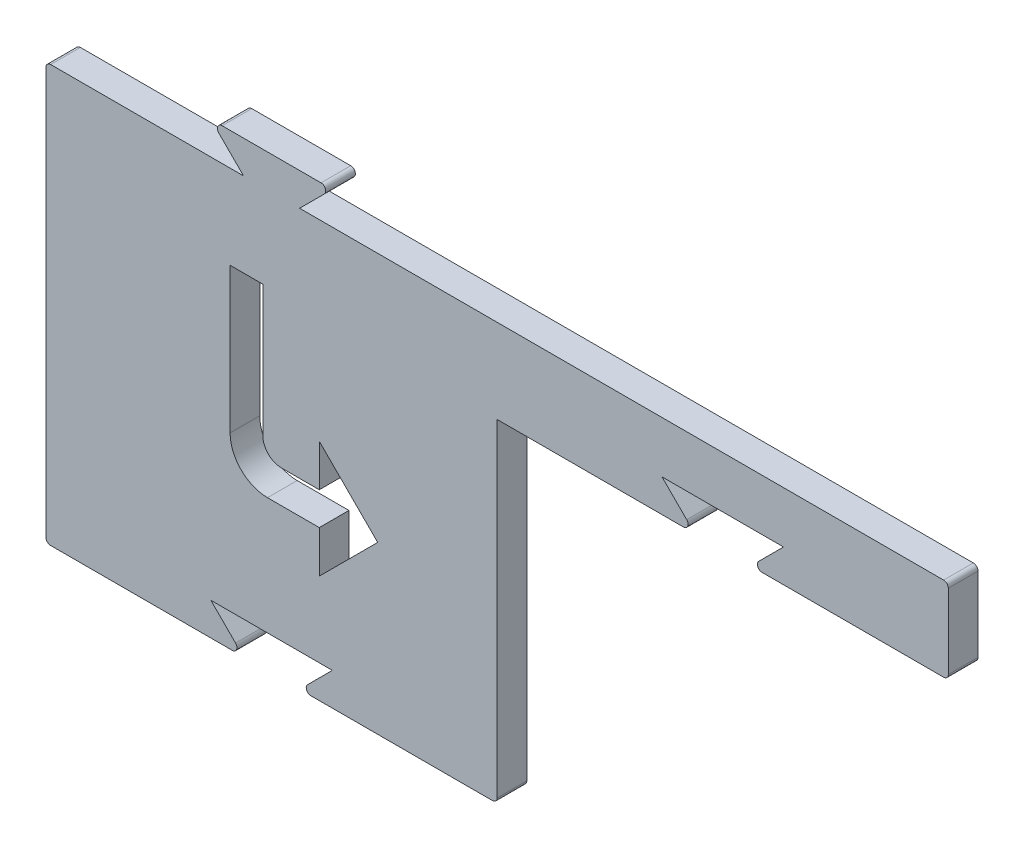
ISO-10303-21;
HEADER;
FILE_DESCRIPTION(('STEP AP214'),'2;1');
FILE_NAME('part.step','',(''),(''),'','','');
FILE_SCHEMA(('AUTOMOTIVE_DESIGN { 1 0 10303 214 1 1 1 1 }'));
ENDSEC;
DATA;
#1=APPLICATION_CONTEXT('core data for automotive mechanical design processes');
#2=APPLICATION_PROTOCOL_DEFINITION('international standard','automotive_design',2000,#1);
#3=PRODUCT_CONTEXT('',#1,'mechanical');
#4=PRODUCT('Part','Part','',(#3));
#5=PRODUCT_RELATED_PRODUCT_CATEGORY('part','',(#4));
#6=PRODUCT_DEFINITION_FORMATION('','',#4);
#7=PRODUCT_DEFINITION_CONTEXT('part definition',#1,'design');
#8=PRODUCT_DEFINITION('design','',#6,#7);
#9=PRODUCT_DEFINITION_SHAPE('','',#8);
#10=(LENGTH_UNIT() NAMED_UNIT(*) SI_UNIT(.MILLI.,.METRE.));
#11=(NAMED_UNIT(*) PLANE_ANGLE_UNIT() SI_UNIT($,.RADIAN.));
#12=(NAMED_UNIT(*) SI_UNIT($,.STERADIAN.) SOLID_ANGLE_UNIT());
#13=UNCERTAINTY_MEASURE_WITH_UNIT(LENGTH_MEASURE(1.E-05),#10,'distance_accuracy_value','');
#14=(GEOMETRIC_REPRESENTATION_CONTEXT(3) GLOBAL_UNCERTAINTY_ASSIGNED_CONTEXT((#13)) GLOBAL_UNIT_ASSIGNED_CONTEXT((#10,
#11,#12)) REPRESENTATION_CONTEXT('',''));
#15=CARTESIAN_POINT('',(0.,0.,0.));
#16=DIRECTION('',(0.,0.,1.));
#17=DIRECTION('',(1.,0.,0.));
#18=AXIS2_PLACEMENT_3D('',#15,#16,#17);
#19=CARTESIAN_POINT('',(0.,0.,3.175));
#20=DIRECTION('',(0.,1.,0.));
#21=DIRECTION('',(-1.,0.,0.));
#22=AXIS2_PLACEMENT_3D('',#19,#20,#21);
#23=PLANE('',#22);
#24=DIRECTION('',(1.,0.,0.));
#25=VECTOR('',#24,1.);
#26=CARTESIAN_POINT('',(0.,0.,3.175));
#27=LINE('',#26,#25);
#28=CARTESIAN_POINT('',(0.499999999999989,0.,3.175));
#29=VERTEX_POINT('',#28);
#30=CARTESIAN_POINT('',(19.9228932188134,0.,3.175));
#31=VERTEX_POINT('',#30);
#32=EDGE_CURVE('E376',#29,#31,#27,.T.);
#33=ORIENTED_EDGE('',*,*,#32,.F.);
#34=DIRECTION('',(0.,0.,-1.));
#35=VECTOR('',#34,1.);
#36=CARTESIAN_POINT('',(0.499999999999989,0.,3.175));
#37=LINE('',#36,#35);
#38=CARTESIAN_POINT('',(0.499999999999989,0.,0.));
#39=VERTEX_POINT('',#38);
#40=EDGE_CURVE('E503',#29,#39,#37,.T.);
#41=ORIENTED_EDGE('',*,*,#40,.T.);
#42=DIRECTION('',(1.,0.,0.));
#43=VECTOR('',#42,1.);
#44=CARTESIAN_POINT('',(0.,0.,0.));
#45=LINE('',#44,#43);
#46=CARTESIAN_POINT('',(19.9228932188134,0.,0.));
#47=VERTEX_POINT('',#46);
#48=EDGE_CURVE('E362',#39,#47,#45,.T.);
#49=ORIENTED_EDGE('',*,*,#48,.T.);
#50=DIRECTION('',(0.,0.,-1.));
#51=VECTOR('',#50,1.);
#52=CARTESIAN_POINT('',(19.9228932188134,0.,3.175));
#53=LINE('',#52,#51);
#54=EDGE_CURVE('E501',#47,#31,#53,.F.);
#55=ORIENTED_EDGE('',*,*,#54,.T.);
#56=EDGE_LOOP('',(#33,#41,#49,#55));
#57=FACE_BOUND('',#56,.T.);
#58=ADVANCED_FACE('F32',(#57),#23,.F.);
#59=CARTESIAN_POINT('',(21.13,0.,3.175));
#60=DIRECTION('',(-0.707106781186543,-0.707106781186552,0.));
#61=DIRECTION('',(0.707106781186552,-0.707106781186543,0.));
#62=AXIS2_PLACEMENT_3D('',#59,#60,#61);
#63=PLANE('',#62);
#64=DIRECTION('',(-0.707106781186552,0.707106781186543,0.));
#65=VECTOR('',#64,1.);
#66=CARTESIAN_POINT('',(21.13,0.,3.175));
#67=LINE('',#66,#65);
#68=CARTESIAN_POINT('',(20.2764466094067,0.853553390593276,3.175));
#69=VERTEX_POINT('',#68);
#70=CARTESIAN_POINT('',(17.63,3.5,3.175));
#71=VERTEX_POINT('',#70);
#72=EDGE_CURVE('E380',#69,#71,#67,.T.);
#73=ORIENTED_EDGE('',*,*,#72,.F.);
#74=DIRECTION('',(0.,0.,-1.));
#75=VECTOR('',#74,1.);
#76=CARTESIAN_POINT('',(20.2764466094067,0.853553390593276,3.175));
#77=LINE('',#76,#75);
#78=CARTESIAN_POINT('',(20.2764466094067,0.853553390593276,0.));
#79=VERTEX_POINT('',#78);
#80=EDGE_CURVE('E11',#69,#79,#77,.T.);
#81=ORIENTED_EDGE('',*,*,#80,.T.);
#82=DIRECTION('',(-0.707106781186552,0.707106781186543,0.));
#83=VECTOR('',#82,1.);
#84=CARTESIAN_POINT('',(21.13,0.,0.));
#85=LINE('',#84,#83);
#86=CARTESIAN_POINT('',(17.63,3.5,0.));
#87=VERTEX_POINT('',#86);
#88=EDGE_CURVE('E422',#79,#87,#85,.T.);
#89=ORIENTED_EDGE('',*,*,#88,.T.);
#90=DIRECTION('',(0.,0.,-1.));
#91=VECTOR('',#90,1.);
#92=CARTESIAN_POINT('',(17.63,3.5,3.175));
#93=LINE('',#92,#91);
#94=EDGE_CURVE('E481',#71,#87,#93,.T.);
#95=ORIENTED_EDGE('',*,*,#94,.F.);
#96=EDGE_LOOP('',(#73,#81,#89,#95));
#97=FACE_BOUND('',#96,.T.);
#98=ADVANCED_FACE('F714',(#97),#63,.F.);
#99=CARTESIAN_POINT('',(17.63,3.5,3.175));
#100=DIRECTION('',(0.,1.,0.));
#101=DIRECTION('',(0.,0.,1.));
#102=AXIS2_PLACEMENT_3D('',#99,#100,#101);
#103=PLANE('',#102);
#104=DIRECTION('',(1.,0.,0.));
#105=VECTOR('',#104,1.);
#106=CARTESIAN_POINT('',(17.63,3.5,0.));
#107=LINE('',#106,#105);
#108=CARTESIAN_POINT('',(30.6300000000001,3.5,0.));
#109=VERTEX_POINT('',#108);
#110=EDGE_CURVE('E424',#87,#109,#107,.T.);
#111=ORIENTED_EDGE('',*,*,#110,.T.);
#112=DIRECTION('',(0.,0.,-1.));
#113=VECTOR('',#112,1.);
#114=CARTESIAN_POINT('',(30.6300000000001,3.5,3.175));
#115=LINE('',#114,#113);
#116=CARTESIAN_POINT('',(30.6300000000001,3.5,3.175));
#117=VERTEX_POINT('',#116);
#118=EDGE_CURVE('E478',#117,#109,#115,.T.);
#119=ORIENTED_EDGE('',*,*,#118,.F.);
#120=DIRECTION('',(1.,0.,0.));
#121=VECTOR('',#120,1.);
#122=CARTESIAN_POINT('',(17.63,3.5,3.175));
#123=LINE('',#122,#121);
#124=EDGE_CURVE('E382',#71,#117,#123,.T.);
#125=ORIENTED_EDGE('',*,*,#124,.F.);
#126=ORIENTED_EDGE('',*,*,#94,.T.);
#127=EDGE_LOOP('',(#111,#119,#125,#126));
#128=FACE_BOUND('',#127,.T.);
#129=ADVANCED_FACE('F718',(#128),#103,.F.);
#130=CARTESIAN_POINT('',(30.6300000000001,3.5,3.175));
#131=DIRECTION('',(0.707106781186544,-0.707106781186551,0.));
#132=DIRECTION('',(0.707106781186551,0.707106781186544,0.));
#133=AXIS2_PLACEMENT_3D('',#130,#131,#132);
#134=PLANE('',#133);
#135=DIRECTION('',(-0.707106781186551,-0.707106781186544,0.));
#136=VECTOR('',#135,1.);
#137=CARTESIAN_POINT('',(30.6300000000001,3.5,0.));
#138=LINE('',#137,#136);
#139=CARTESIAN_POINT('',(27.9835533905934,0.853553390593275,0.));
#140=VERTEX_POINT('',#139);
#141=EDGE_CURVE('E426',#109,#140,#138,.T.);
#142=ORIENTED_EDGE('',*,*,#141,.T.);
#143=DIRECTION('',(0.,0.,-1.));
#144=VECTOR('',#143,1.);
#145=CARTESIAN_POINT('',(27.9835533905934,0.853553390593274,3.175));
#146=LINE('',#145,#144);
#147=CARTESIAN_POINT('',(27.9835533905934,0.853553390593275,3.175));
#148=VERTEX_POINT('',#147);
#149=EDGE_CURVE('E40',#140,#148,#146,.F.);
#150=ORIENTED_EDGE('',*,*,#149,.T.);
#151=DIRECTION('',(-0.707106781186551,-0.707106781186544,0.));
#152=VECTOR('',#151,1.);
#153=CARTESIAN_POINT('',(30.6300000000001,3.5,3.175));
#154=LINE('',#153,#152);
#155=EDGE_CURVE('E384',#117,#148,#154,.T.);
#156=ORIENTED_EDGE('',*,*,#155,.F.);
#157=ORIENTED_EDGE('',*,*,#118,.T.);
#158=EDGE_LOOP('',(#142,#150,#156,#157));
#159=FACE_BOUND('',#158,.T.);
#160=ADVANCED_FACE('F595',(#159),#134,.F.);
#161=CARTESIAN_POINT('',(27.1300000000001,0.,3.175));
#162=DIRECTION('',(0.,1.,0.));
#163=DIRECTION('',(-1.,0.,0.));
#164=AXIS2_PLACEMENT_3D('',#161,#162,#163);
#165=PLANE('',#164);
#166=DIRECTION('',(1.,0.,0.));
#167=VECTOR('',#166,1.);
#168=CARTESIAN_POINT('',(27.1300000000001,0.,0.));
#169=LINE('',#168,#167);
#170=CARTESIAN_POINT('',(28.3371067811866,0.,0.));
#171=VERTEX_POINT('',#170);
#172=CARTESIAN_POINT('',(47.76,0.,0.));
#173=VERTEX_POINT('',#172);
#174=EDGE_CURVE('E429',#171,#173,#169,.T.);
#175=ORIENTED_EDGE('',*,*,#174,.T.);
#176=DIRECTION('',(0.,0.,-1.));
#177=VECTOR('',#176,1.);
#178=CARTESIAN_POINT('',(47.76,0.,3.175));
#179=LINE('',#178,#177);
#180=CARTESIAN_POINT('',(47.76,0.,3.175));
#181=VERTEX_POINT('',#180);
#182=EDGE_CURVE('E560',#173,#181,#179,.F.);
#183=ORIENTED_EDGE('',*,*,#182,.T.);
#184=DIRECTION('',(1.,0.,0.));
#185=VECTOR('',#184,1.);
#186=CARTESIAN_POINT('',(27.1300000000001,0.,3.175));
#187=LINE('',#186,#185);
#188=CARTESIAN_POINT('',(28.3371067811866,0.,3.175));
#189=VERTEX_POINT('',#188);
#190=EDGE_CURVE('E387',#189,#181,#187,.T.);
#191=ORIENTED_EDGE('',*,*,#190,.F.);
#192=DIRECTION('',(0.,0.,-1.));
#193=VECTOR('',#192,1.);
#194=CARTESIAN_POINT('',(28.3371067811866,0.,3.175));
#195=LINE('',#194,#193);
#196=EDGE_CURVE('E557',#189,#171,#195,.T.);
#197=ORIENTED_EDGE('',*,*,#196,.T.);
#198=EDGE_LOOP('',(#175,#183,#191,#197));
#199=FACE_BOUND('',#198,.T.);
#200=ADVANCED_FACE('F607',(#199),#165,.F.);
#201=CARTESIAN_POINT('',(48.26,35.56,3.175));
#202=DIRECTION('',(-1.,0.,0.));
#203=DIRECTION('',(0.,0.,1.));
#204=AXIS2_PLACEMENT_3D('',#201,#202,#203);
#205=PLANE('',#204);
#206=DIRECTION('',(0.,1.,0.));
#207=VECTOR('',#206,1.);
#208=CARTESIAN_POINT('',(48.26,35.56,3.175));
#209=LINE('',#208,#207);
#210=CARTESIAN_POINT('',(48.26,0.500000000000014,3.175));
#211=VERTEX_POINT('',#210);
#212=CARTESIAN_POINT('',(48.26,35.56,3.175));
#213=VERTEX_POINT('',#212);
#214=EDGE_CURVE('E390',#211,#213,#209,.T.);
#215=ORIENTED_EDGE('',*,*,#214,.F.);
#216=DIRECTION('',(0.,0.,-1.));
#217=VECTOR('',#216,1.);
#218=CARTESIAN_POINT('',(48.26,0.5,3.175));
#219=LINE('',#218,#217);
#220=CARTESIAN_POINT('',(48.26,0.500000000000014,0.));
#221=VERTEX_POINT('',#220);
#222=EDGE_CURVE('E554',#211,#221,#219,.T.);
#223=ORIENTED_EDGE('',*,*,#222,.T.);
#224=DIRECTION('',(0.,1.,0.));
#225=VECTOR('',#224,1.);
#226=CARTESIAN_POINT('',(48.26,35.56,0.));
#227=LINE('',#226,#225);
#228=CARTESIAN_POINT('',(48.26,35.56,0.));
#229=VERTEX_POINT('',#228);
#230=EDGE_CURVE('E432',#221,#229,#227,.T.);
#231=ORIENTED_EDGE('',*,*,#230,.T.);
#232=DIRECTION('',(0.,0.,-1.));
#233=VECTOR('',#232,1.);
#234=CARTESIAN_POINT('',(48.26,35.56,3.175));
#235=LINE('',#234,#233);
#236=EDGE_CURVE('E475',#213,#229,#235,.T.);
#237=ORIENTED_EDGE('',*,*,#236,.F.);
#238=EDGE_LOOP('',(#215,#223,#231,#237));
#239=FACE_BOUND('',#238,.T.);
#240=ADVANCED_FACE('F618',(#239),#205,.F.);
#241=CARTESIAN_POINT('',(69.39,35.56,3.175));
#242=DIRECTION('',(0.,1.,0.));
#243=DIRECTION('',(-1.,0.,0.));
#244=AXIS2_PLACEMENT_3D('',#241,#242,#243);
#245=PLANE('',#244);
#246=DIRECTION('',(1.,0.,0.));
#247=VECTOR('',#246,1.);
#248=CARTESIAN_POINT('',(69.39,35.56,0.));
#249=LINE('',#248,#247);
#250=CARTESIAN_POINT('',(68.1828932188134,35.56,0.));
#251=VERTEX_POINT('',#250);
#252=EDGE_CURVE('E434',#229,#251,#249,.T.);
#253=ORIENTED_EDGE('',*,*,#252,.T.);
#254=DIRECTION('',(0.,0.,-1.));
#255=VECTOR('',#254,1.);
#256=CARTESIAN_POINT('',(68.1828932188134,35.56,3.175));
#257=LINE('',#256,#255);
#258=CARTESIAN_POINT('',(68.1828932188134,35.56,3.175));
#259=VERTEX_POINT('',#258);
#260=EDGE_CURVE('E584',#251,#259,#257,.F.);
#261=ORIENTED_EDGE('',*,*,#260,.T.);
#262=DIRECTION('',(1.,0.,0.));
#263=VECTOR('',#262,1.);
#264=CARTESIAN_POINT('',(69.39,35.56,3.175));
#265=LINE('',#264,#263);
#266=EDGE_CURVE('E392',#213,#259,#265,.T.);
#267=ORIENTED_EDGE('',*,*,#266,.F.);
#268=ORIENTED_EDGE('',*,*,#236,.T.);
#269=EDGE_LOOP('',(#253,#261,#267,#268));
#270=FACE_BOUND('',#269,.T.);
#271=ADVANCED_FACE('F925',(#270),#245,.F.);
#272=CARTESIAN_POINT('',(65.8899999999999,39.06,3.175));
#273=DIRECTION('',(-0.707106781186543,-0.707106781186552,0.));
#274=DIRECTION('',(0.707106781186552,-0.707106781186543,0.));
#275=AXIS2_PLACEMENT_3D('',#272,#273,#274);
#276=PLANE('',#275);
#277=DIRECTION('',(-0.707106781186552,0.707106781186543,0.));
#278=VECTOR('',#277,1.);
#279=CARTESIAN_POINT('',(65.8899999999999,39.06,3.175));
#280=LINE('',#279,#278);
#281=CARTESIAN_POINT('',(68.5364466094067,36.4135533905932,3.175));
#282=VERTEX_POINT('',#281);
#283=CARTESIAN_POINT('',(65.8899999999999,39.06,3.175));
#284=VERTEX_POINT('',#283);
#285=EDGE_CURVE('E395',#282,#284,#280,.T.);
#286=ORIENTED_EDGE('',*,*,#285,.F.);
#287=DIRECTION('',(0.,0.,-1.));
#288=VECTOR('',#287,1.);
#289=CARTESIAN_POINT('',(68.5364466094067,36.4135533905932,3.175));
#290=LINE('',#289,#288);
#291=CARTESIAN_POINT('',(68.5364466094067,36.4135533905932,0.));
#292=VERTEX_POINT('',#291);
#293=EDGE_CURVE('E581',#282,#292,#290,.T.);
#294=ORIENTED_EDGE('',*,*,#293,.T.);
#295=DIRECTION('',(-0.707106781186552,0.707106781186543,0.));
#296=VECTOR('',#295,1.);
#297=CARTESIAN_POINT('',(65.8899999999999,39.06,0.));
#298=LINE('',#297,#296);
#299=CARTESIAN_POINT('',(65.8899999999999,39.06,0.));
#300=VERTEX_POINT('',#299);
#301=EDGE_CURVE('E437',#292,#300,#298,.T.);
#302=ORIENTED_EDGE('',*,*,#301,.T.);
#303=DIRECTION('',(0.,0.,-1.));
#304=VECTOR('',#303,1.);
#305=CARTESIAN_POINT('',(65.8899999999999,39.06,3.175));
#306=LINE('',#305,#304);
#307=EDGE_CURVE('E472',#284,#300,#306,.T.);
#308=ORIENTED_EDGE('',*,*,#307,.F.);
#309=EDGE_LOOP('',(#286,#294,#302,#308));
#310=FACE_BOUND('',#309,.T.);
#311=ADVANCED_FACE('F630',(#310),#276,.F.);
#312=CARTESIAN_POINT('',(78.89,39.06,3.175));
#313=DIRECTION('',(0.,1.,0.));
#314=DIRECTION('',(0.,0.,1.));
#315=AXIS2_PLACEMENT_3D('',#312,#313,#314);
#316=PLANE('',#315);
#317=DIRECTION('',(1.,0.,0.));
#318=VECTOR('',#317,1.);
#319=CARTESIAN_POINT('',(78.89,39.06,0.));
#320=LINE('',#319,#318);
#321=CARTESIAN_POINT('',(78.89,39.06,0.));
#322=VERTEX_POINT('',#321);
#323=EDGE_CURVE('E439',#300,#322,#320,.T.);
#324=ORIENTED_EDGE('',*,*,#323,.T.);
#325=DIRECTION('',(0.,0.,-1.));
#326=VECTOR('',#325,1.);
#327=CARTESIAN_POINT('',(78.89,39.06,3.175));
#328=LINE('',#327,#326);
#329=CARTESIAN_POINT('',(78.89,39.06,3.175));
#330=VERTEX_POINT('',#329);
#331=EDGE_CURVE('E469',#330,#322,#328,.T.);
#332=ORIENTED_EDGE('',*,*,#331,.F.);
#333=DIRECTION('',(1.,0.,0.));
#334=VECTOR('',#333,1.);
#335=CARTESIAN_POINT('',(78.89,39.06,3.175));
#336=LINE('',#335,#334);
#337=EDGE_CURVE('E397',#284,#330,#336,.T.);
#338=ORIENTED_EDGE('',*,*,#337,.F.);
#339=ORIENTED_EDGE('',*,*,#307,.T.);
#340=EDGE_LOOP('',(#324,#332,#338,#339));
#341=FACE_BOUND('',#340,.T.);
#342=ADVANCED_FACE('F636',(#341),#316,.F.);
#343=CARTESIAN_POINT('',(75.39,35.56,3.175));
#344=DIRECTION('',(0.707106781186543,-0.707106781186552,0.));
#345=DIRECTION('',(0.707106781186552,0.707106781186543,0.));
#346=AXIS2_PLACEMENT_3D('',#343,#344,#345);
#347=PLANE('',#346);
#348=DIRECTION('',(-0.707106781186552,-0.707106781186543,0.));
#349=VECTOR('',#348,1.);
#350=CARTESIAN_POINT('',(75.39,35.56,0.));
#351=LINE('',#350,#349);
#352=CARTESIAN_POINT('',(76.2435533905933,36.4135533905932,0.));
#353=VERTEX_POINT('',#352);
#354=EDGE_CURVE('E441',#322,#353,#351,.T.);
#355=ORIENTED_EDGE('',*,*,#354,.T.);
#356=DIRECTION('',(0.,0.,-1.));
#357=VECTOR('',#356,1.);
#358=CARTESIAN_POINT('',(76.2435533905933,36.4135533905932,3.175));
#359=LINE('',#358,#357);
#360=CARTESIAN_POINT('',(76.2435533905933,36.4135533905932,3.175));
#361=VERTEX_POINT('',#360);
#362=EDGE_CURVE('E591',#353,#361,#359,.F.);
#363=ORIENTED_EDGE('',*,*,#362,.T.);
#364=DIRECTION('',(-0.707106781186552,-0.707106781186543,0.));
#365=VECTOR('',#364,1.);
#366=CARTESIAN_POINT('',(75.39,35.56,3.175));
#367=LINE('',#366,#365);
#368=EDGE_CURVE('E399',#330,#361,#367,.T.);
#369=ORIENTED_EDGE('',*,*,#368,.F.);
#370=ORIENTED_EDGE('',*,*,#331,.T.);
#371=EDGE_LOOP('',(#355,#363,#369,#370));
#372=FACE_BOUND('',#371,.T.);
#373=ADVANCED_FACE('F640',(#372),#347,.F.);
#374=CARTESIAN_POINT('',(96.52,35.56,3.175));
#375=DIRECTION('',(0.,1.,0.));
#376=DIRECTION('',(0.,0.,1.));
#377=AXIS2_PLACEMENT_3D('',#374,#375,#376);
#378=PLANE('',#377);
#379=DIRECTION('',(1.,0.,0.));
#380=VECTOR('',#379,1.);
#381=CARTESIAN_POINT('',(96.52,35.56,0.));
#382=LINE('',#381,#380);
#383=CARTESIAN_POINT('',(76.5971067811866,35.56,0.));
#384=VERTEX_POINT('',#383);
#385=CARTESIAN_POINT('',(96.02,35.56,0.));
#386=VERTEX_POINT('',#385);
#387=EDGE_CURVE('E444',#384,#386,#382,.T.);
#388=ORIENTED_EDGE('',*,*,#387,.T.);
#389=DIRECTION('',(0.,0.,-1.));
#390=VECTOR('',#389,1.);
#391=CARTESIAN_POINT('',(96.02,35.56,3.175));
#392=LINE('',#391,#390);
#393=CARTESIAN_POINT('',(96.02,35.56,3.175));
#394=VERTEX_POINT('',#393);
#395=EDGE_CURVE('E589',#386,#394,#392,.F.);
#396=ORIENTED_EDGE('',*,*,#395,.T.);
#397=DIRECTION('',(1.,0.,0.));
#398=VECTOR('',#397,1.);
#399=CARTESIAN_POINT('',(96.52,35.56,3.175));
#400=LINE('',#399,#398);
#401=CARTESIAN_POINT('',(76.5971067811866,35.56,3.175));
#402=VERTEX_POINT('',#401);
#403=EDGE_CURVE('E402',#402,#394,#400,.T.);
#404=ORIENTED_EDGE('',*,*,#403,.F.);
#405=DIRECTION('',(0.,0.,-1.));
#406=VECTOR('',#405,1.);
#407=CARTESIAN_POINT('',(76.5971067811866,35.56,3.175));
#408=LINE('',#407,#406);
#409=EDGE_CURVE('E586',#402,#384,#408,.T.);
#410=ORIENTED_EDGE('',*,*,#409,.T.);
#411=EDGE_LOOP('',(#388,#396,#404,#410));
#412=FACE_BOUND('',#411,.T.);
#413=ADVANCED_FACE('F649',(#412),#378,.F.);
#414=CARTESIAN_POINT('',(96.52,44.56,3.175));
#415=DIRECTION('',(-1.,0.,0.));
#416=DIRECTION('',(0.,0.,1.));
#417=AXIS2_PLACEMENT_3D('',#414,#415,#416);
#418=PLANE('',#417);
#419=DIRECTION('',(0.,1.,0.));
#420=VECTOR('',#419,1.);
#421=CARTESIAN_POINT('',(96.52,44.56,0.));
#422=LINE('',#421,#420);
#423=CARTESIAN_POINT('',(96.52,36.06,0.));
#424=VERTEX_POINT('',#423);
#425=CARTESIAN_POINT('',(96.52,44.06,0.));
#426=VERTEX_POINT('',#425);
#427=EDGE_CURVE('E447',#424,#426,#422,.T.);
#428=ORIENTED_EDGE('',*,*,#427,.T.);
#429=DIRECTION('',(0.,0.,-1.));
#430=VECTOR('',#429,1.);
#431=CARTESIAN_POINT('',(96.52,44.06,3.175));
#432=LINE('',#431,#430);
#433=CARTESIAN_POINT('',(96.52,44.06,3.175));
#434=VERTEX_POINT('',#433);
#435=EDGE_CURVE('E579',#426,#434,#432,.F.);
#436=ORIENTED_EDGE('',*,*,#435,.T.);
#437=DIRECTION('',(0.,1.,0.));
#438=VECTOR('',#437,1.);
#439=CARTESIAN_POINT('',(96.52,44.56,3.175));
#440=LINE('',#439,#438);
#441=CARTESIAN_POINT('',(96.52,36.06,3.175));
#442=VERTEX_POINT('',#441);
#443=EDGE_CURVE('E405',#442,#434,#440,.T.);
#444=ORIENTED_EDGE('',*,*,#443,.F.);
#445=DIRECTION('',(0.,0.,-1.));
#446=VECTOR('',#445,1.);
#447=CARTESIAN_POINT('',(96.52,36.06,3.175));
#448=LINE('',#447,#446);
#449=EDGE_CURVE('E576',#442,#424,#448,.T.);
#450=ORIENTED_EDGE('',*,*,#449,.T.);
#451=EDGE_LOOP('',(#428,#436,#444,#450));
#452=FACE_BOUND('',#451,.T.);
#453=ADVANCED_FACE('F658',(#452),#418,.F.);
#454=CARTESIAN_POINT('',(27.1300000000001,44.56,3.175));
#455=DIRECTION('',(0.,-1.,0.));
#456=DIRECTION('',(0.,0.,-1.));
#457=AXIS2_PLACEMENT_3D('',#454,#455,#456);
#458=PLANE('',#457);
#459=DIRECTION('',(-1.,0.,0.));
#460=VECTOR('',#459,1.);
#461=CARTESIAN_POINT('',(27.1300000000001,44.56,3.175));
#462=LINE('',#461,#460);
#463=CARTESIAN_POINT('',(96.02,44.56,3.175));
#464=VERTEX_POINT('',#463);
#465=CARTESIAN_POINT('',(27.1300000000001,44.56,3.175));
#466=VERTEX_POINT('',#465);
#467=EDGE_CURVE('E408',#464,#466,#462,.T.);
#468=ORIENTED_EDGE('',*,*,#467,.F.);
#469=DIRECTION('',(0.,0.,-1.));
#470=VECTOR('',#469,1.);
#471=CARTESIAN_POINT('',(96.02,44.56,3.175));
#472=LINE('',#471,#470);
#473=CARTESIAN_POINT('',(96.02,44.56,0.));
#474=VERTEX_POINT('',#473);
#475=EDGE_CURVE('E573',#464,#474,#472,.T.);
#476=ORIENTED_EDGE('',*,*,#475,.T.);
#477=DIRECTION('',(-1.,0.,0.));
#478=VECTOR('',#477,1.);
#479=CARTESIAN_POINT('',(27.1300000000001,44.56,0.));
#480=LINE('',#479,#478);
#481=CARTESIAN_POINT('',(27.1300000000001,44.56,0.));
#482=VERTEX_POINT('',#481);
#483=EDGE_CURVE('E450',#474,#482,#480,.T.);
#484=ORIENTED_EDGE('',*,*,#483,.T.);
#485=DIRECTION('',(0.,0.,-1.));
#486=VECTOR('',#485,1.);
#487=CARTESIAN_POINT('',(27.1300000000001,44.56,3.175));
#488=LINE('',#487,#486);
#489=EDGE_CURVE('E466',#466,#482,#488,.T.);
#490=ORIENTED_EDGE('',*,*,#489,.F.);
#491=EDGE_LOOP('',(#468,#476,#484,#490));
#492=FACE_BOUND('',#491,.T.);
#493=ADVANCED_FACE('F667',(#492),#458,.F.);
#494=CARTESIAN_POINT('',(30.63,48.06,3.175));
#495=DIRECTION('',(-0.707106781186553,0.707106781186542,0.));
#496=DIRECTION('',(-0.707106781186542,-0.707106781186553,0.));
#497=AXIS2_PLACEMENT_3D('',#494,#495,#496);
#498=PLANE('',#497);
#499=DIRECTION('',(0.707106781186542,0.707106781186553,0.));
#500=VECTOR('',#499,1.);
#501=CARTESIAN_POINT('',(30.63,48.06,0.));
#502=LINE('',#501,#500);
#503=CARTESIAN_POINT('',(29.7764466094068,47.2064466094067,0.));
#504=VERTEX_POINT('',#503);
#505=EDGE_CURVE('E452',#482,#504,#502,.T.);
#506=ORIENTED_EDGE('',*,*,#505,.T.);
#507=DIRECTION('',(0.,0.,-1.));
#508=VECTOR('',#507,1.);
#509=CARTESIAN_POINT('',(29.7764466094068,47.2064466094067,3.175));
#510=LINE('',#509,#508);
#511=CARTESIAN_POINT('',(29.7764466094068,47.2064466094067,3.175));
#512=VERTEX_POINT('',#511);
#513=EDGE_CURVE('E571',#504,#512,#510,.F.);
#514=ORIENTED_EDGE('',*,*,#513,.T.);
#515=DIRECTION('',(0.707106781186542,0.707106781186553,0.));
#516=VECTOR('',#515,1.);
#517=CARTESIAN_POINT('',(30.63,48.06,3.175));
#518=LINE('',#517,#516);
#519=EDGE_CURVE('E410',#466,#512,#518,.T.);
#520=ORIENTED_EDGE('',*,*,#519,.F.);
#521=ORIENTED_EDGE('',*,*,#489,.T.);
#522=EDGE_LOOP('',(#506,#514,#520,#521));
#523=FACE_BOUND('',#522,.T.);
#524=ADVANCED_FACE('F673',(#523),#498,.F.);
#525=CARTESIAN_POINT('',(17.63,48.06,3.175));
#526=DIRECTION('',(0.,-1.,0.));
#527=DIRECTION('',(0.,0.,-1.));
#528=AXIS2_PLACEMENT_3D('',#525,#526,#527);
#529=PLANE('',#528);
#530=DIRECTION('',(-1.,0.,0.));
#531=VECTOR('',#530,1.);
#532=CARTESIAN_POINT('',(17.63,48.06,0.));
#533=LINE('',#532,#531);
#534=CARTESIAN_POINT('',(29.4228932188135,48.06,0.));
#535=VERTEX_POINT('',#534);
#536=CARTESIAN_POINT('',(18.8371067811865,48.06,0.));
#537=VERTEX_POINT('',#536);
#538=EDGE_CURVE('E455',#535,#537,#533,.T.);
#539=ORIENTED_EDGE('',*,*,#538,.T.);
#540=DIRECTION('',(0.,0.,-1.));
#541=VECTOR('',#540,1.);
#542=CARTESIAN_POINT('',(18.8371067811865,48.06,3.175));
#543=LINE('',#542,#541);
#544=CARTESIAN_POINT('',(18.8371067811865,48.06,3.175));
#545=VERTEX_POINT('',#544);
#546=EDGE_CURVE('E569',#537,#545,#543,.F.);
#547=ORIENTED_EDGE('',*,*,#546,.T.);
#548=DIRECTION('',(-1.,0.,0.));
#549=VECTOR('',#548,1.);
#550=CARTESIAN_POINT('',(17.63,48.06,3.175));
#551=LINE('',#550,#549);
#552=CARTESIAN_POINT('',(29.4228932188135,48.06,3.175));
#553=VERTEX_POINT('',#552);
#554=EDGE_CURVE('E413',#553,#545,#551,.T.);
#555=ORIENTED_EDGE('',*,*,#554,.F.);
#556=DIRECTION('',(0.,0.,-1.));
#557=VECTOR('',#556,1.);
#558=CARTESIAN_POINT('',(29.4228932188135,48.06,3.175));
#559=LINE('',#558,#557);
#560=EDGE_CURVE('E566',#553,#535,#559,.T.);
#561=ORIENTED_EDGE('',*,*,#560,.T.);
#562=EDGE_LOOP('',(#539,#547,#555,#561));
#563=FACE_BOUND('',#562,.T.);
#564=ADVANCED_FACE('F681',(#563),#529,.F.);
#565=CARTESIAN_POINT('',(21.13,44.56,3.175));
#566=DIRECTION('',(0.707106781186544,0.707106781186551,0.));
#567=DIRECTION('',(-0.707106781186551,0.707106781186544,0.));
#568=AXIS2_PLACEMENT_3D('',#565,#566,#567);
#569=PLANE('',#568);
#570=DIRECTION('',(0.707106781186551,-0.707106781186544,0.));
#571=VECTOR('',#570,1.);
#572=CARTESIAN_POINT('',(21.13,44.56,3.175));
#573=LINE('',#572,#571);
#574=CARTESIAN_POINT('',(18.4835533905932,47.2064466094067,3.175));
#575=VERTEX_POINT('',#574);
#576=CARTESIAN_POINT('',(21.13,44.56,3.175));
#577=VERTEX_POINT('',#576);
#578=EDGE_CURVE('E415',#575,#577,#573,.T.);
#579=ORIENTED_EDGE('',*,*,#578,.F.);
#580=DIRECTION('',(0.,0.,-1.));
#581=VECTOR('',#580,1.);
#582=CARTESIAN_POINT('',(18.4835533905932,47.2064466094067,3.175));
#583=LINE('',#582,#581);
#584=CARTESIAN_POINT('',(18.4835533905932,47.2064466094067,0.));
#585=VERTEX_POINT('',#584);
#586=EDGE_CURVE('E563',#575,#585,#583,.T.);
#587=ORIENTED_EDGE('',*,*,#586,.T.);
#588=DIRECTION('',(0.707106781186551,-0.707106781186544,0.));
#589=VECTOR('',#588,1.);
#590=CARTESIAN_POINT('',(21.13,44.56,0.));
#591=LINE('',#590,#589);
#592=CARTESIAN_POINT('',(21.13,44.56,0.));
#593=VERTEX_POINT('',#592);
#594=EDGE_CURVE('E458',#585,#593,#591,.T.);
#595=ORIENTED_EDGE('',*,*,#594,.T.);
#596=DIRECTION('',(0.,0.,-1.));
#597=VECTOR('',#596,1.);
#598=CARTESIAN_POINT('',(21.13,44.56,3.175));
#599=LINE('',#598,#597);
#600=EDGE_CURVE('E419',#577,#593,#599,.T.);
#601=ORIENTED_EDGE('',*,*,#600,.F.);
#602=EDGE_LOOP('',(#579,#587,#595,#601));
#603=FACE_BOUND('',#602,.T.);
#604=ADVANCED_FACE('F688',(#603),#569,.F.);
#605=CARTESIAN_POINT('',(0.,44.56,3.175));
#606=DIRECTION('',(0.,-1.,0.));
#607=DIRECTION('',(0.,0.,-1.));
#608=AXIS2_PLACEMENT_3D('',#605,#606,#607);
#609=PLANE('',#608);
#610=DIRECTION('',(-1.,0.,0.));
#611=VECTOR('',#610,1.);
#612=CARTESIAN_POINT('',(0.,44.56,0.));
#613=LINE('',#612,#611);
#614=CARTESIAN_POINT('',(0.5,44.56,0.));
#615=VERTEX_POINT('',#614);
#616=EDGE_CURVE('E460',#593,#615,#613,.T.);
#617=ORIENTED_EDGE('',*,*,#616,.T.);
#618=DIRECTION('',(0.,0.,-1.));
#619=VECTOR('',#618,1.);
#620=CARTESIAN_POINT('',(0.5,44.56,3.175));
#621=LINE('',#620,#619);
#622=CARTESIAN_POINT('',(0.5,44.56,3.175));
#623=VERTEX_POINT('',#622);
#624=EDGE_CURVE('E47',#615,#623,#621,.F.);
#625=ORIENTED_EDGE('',*,*,#624,.T.);
#626=DIRECTION('',(-1.,0.,0.));
#627=VECTOR('',#626,1.);
#628=CARTESIAN_POINT('',(0.,44.56,3.175));
#629=LINE('',#628,#627);
#630=EDGE_CURVE('E417',#577,#623,#629,.T.);
#631=ORIENTED_EDGE('',*,*,#630,.F.);
#632=ORIENTED_EDGE('',*,*,#600,.T.);
#633=EDGE_LOOP('',(#617,#625,#631,#632));
#634=FACE_BOUND('',#633,.T.);
#635=ADVANCED_FACE('F692',(#634),#609,.F.);
#636=CARTESIAN_POINT('',(0.,35.56,3.175));
#637=DIRECTION('',(1.,0.,0.));
#638=DIRECTION('',(0.,1.,0.));
#639=AXIS2_PLACEMENT_3D('',#636,#637,#638);
#640=PLANE('',#639);
#641=DIRECTION('',(0.,-1.,0.));
#642=VECTOR('',#641,1.);
#643=CARTESIAN_POINT('',(0.,35.56,0.));
#644=LINE('',#643,#642);
#645=CARTESIAN_POINT('',(0.,44.06,0.));
#646=VERTEX_POINT('',#645);
#647=CARTESIAN_POINT('',(0.,0.5,0.));
#648=VERTEX_POINT('',#647);
#649=EDGE_CURVE('E377',#646,#648,#644,.T.);
#650=ORIENTED_EDGE('',*,*,#649,.T.);
#651=DIRECTION('',(0.,0.,-1.));
#652=VECTOR('',#651,1.);
#653=CARTESIAN_POINT('',(0.,0.5,3.175));
#654=LINE('',#653,#652);
#655=CARTESIAN_POINT('',(0.,0.5,3.175));
#656=VERTEX_POINT('',#655);
#657=EDGE_CURVE('E531',#648,#656,#654,.F.);
#658=ORIENTED_EDGE('',*,*,#657,.T.);
#659=DIRECTION('',(0.,-1.,0.));
#660=VECTOR('',#659,1.);
#661=CARTESIAN_POINT('',(0.,35.56,3.175));
#662=LINE('',#661,#660);
#663=CARTESIAN_POINT('',(0.,44.06,3.175));
#664=VERTEX_POINT('',#663);
#665=EDGE_CURVE('E373',#664,#656,#662,.T.);
#666=ORIENTED_EDGE('',*,*,#665,.F.);
#667=DIRECTION('',(0.,0.,-1.));
#668=VECTOR('',#667,1.);
#669=CARTESIAN_POINT('',(0.,44.06,3.175));
#670=LINE('',#669,#668);
#671=EDGE_CURVE('E528',#664,#646,#670,.T.);
#672=ORIENTED_EDGE('',*,*,#671,.T.);
#673=EDGE_LOOP('',(#650,#658,#666,#672));
#674=FACE_BOUND('',#673,.T.);
#675=ADVANCED_FACE('F700',(#674),#640,.F.);
#676=CARTESIAN_POINT('',(0.,0.,3.175));
#677=DIRECTION('',(0.,0.,1.));
#678=DIRECTION('',(1.,0.,0.));
#679=AXIS2_PLACEMENT_3D('',#676,#677,#678);
#680=PLANE('',#679);
#681=DIRECTION('',(0.,1.,0.));
#682=VECTOR('',#681,1.);
#683=CARTESIAN_POINT('',(23.1925810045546,35.56,3.175));
#684=LINE('',#683,#682);
#685=CARTESIAN_POINT('',(23.1925810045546,21.53,3.175));
#686=VERTEX_POINT('',#685);
#687=CARTESIAN_POINT('',(23.1925810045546,35.56,3.175));
#688=VERTEX_POINT('',#687);
#689=EDGE_CURVE('E320',#686,#688,#684,.T.);
#690=ORIENTED_EDGE('',*,*,#689,.F.);
#691=CARTESIAN_POINT('',(25.1925810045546,21.53,3.175));
#692=DIRECTION('',(0.,0.,1.));
#693=DIRECTION('',(1.,0.,0.));
#694=AXIS2_PLACEMENT_3D('',#691,#692,#693);
#695=CIRCLE('',#694,2.);
#696=CARTESIAN_POINT('',(25.1925810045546,19.53,3.175));
#697=VERTEX_POINT('',#696);
#698=EDGE_CURVE('E487',#686,#697,#695,.T.);
#699=ORIENTED_EDGE('',*,*,#698,.T.);
#700=DIRECTION('',(-1.,0.,0.));
#701=VECTOR('',#700,1.);
#702=CARTESIAN_POINT('',(23.1925810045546,19.53,3.175));
#703=LINE('',#702,#701);
#704=CARTESIAN_POINT('',(29.2314832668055,19.53,3.175));
#705=VERTEX_POINT('',#704);
#706=EDGE_CURVE('E322',#705,#697,#703,.T.);
#707=ORIENTED_EDGE('',*,*,#706,.F.);
#708=DIRECTION('',(0.,-1.,0.));
#709=VECTOR('',#708,1.);
#710=CARTESIAN_POINT('',(29.2314832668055,19.53,3.175));
#711=LINE('',#710,#709);
#712=CARTESIAN_POINT('',(29.2314832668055,24.03,3.175));
#713=VERTEX_POINT('',#712);
#714=EDGE_CURVE('E355',#713,#705,#711,.T.);
#715=ORIENTED_EDGE('',*,*,#714,.F.);
#716=DIRECTION('',(-0.707106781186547,0.707106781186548,0.));
#717=VECTOR('',#716,1.);
#718=CARTESIAN_POINT('',(29.2314832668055,24.03,3.175));
#719=LINE('',#718,#717);
#720=CARTESIAN_POINT('',(35.4814832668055,17.78,3.175));
#721=VERTEX_POINT('',#720);
#722=EDGE_CURVE('E352',#721,#713,#719,.T.);
#723=ORIENTED_EDGE('',*,*,#722,.F.);
#724=DIRECTION('',(0.707106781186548,0.707106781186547,0.));
#725=VECTOR('',#724,1.);
#726=CARTESIAN_POINT('',(35.4814832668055,17.78,3.175));
#727=LINE('',#726,#725);
#728=CARTESIAN_POINT('',(29.2314832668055,11.53,3.175));
#729=VERTEX_POINT('',#728);
#730=EDGE_CURVE('E349',#729,#721,#727,.T.);
#731=ORIENTED_EDGE('',*,*,#730,.F.);
#732=DIRECTION('',(0.,-1.,0.));
#733=VECTOR('',#732,1.);
#734=CARTESIAN_POINT('',(29.2314832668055,11.53,3.175));
#735=LINE('',#734,#733);
#736=CARTESIAN_POINT('',(29.2314832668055,16.03,3.175));
#737=VERTEX_POINT('',#736);
#738=EDGE_CURVE('E346',#737,#729,#735,.T.);
#739=ORIENTED_EDGE('',*,*,#738,.F.);
#740=DIRECTION('',(1.,0.,0.));
#741=VECTOR('',#740,1.);
#742=CARTESIAN_POINT('',(29.2314832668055,16.03,3.175));
#743=LINE('',#742,#741);
#744=CARTESIAN_POINT('',(23.6925810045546,16.03,3.175));
#745=VERTEX_POINT('',#744);
#746=EDGE_CURVE('E344',#745,#737,#743,.T.);
#747=ORIENTED_EDGE('',*,*,#746,.F.);
#748=CARTESIAN_POINT('',(23.6925810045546,20.03,3.175));
#749=DIRECTION('',(0.,0.,1.));
#750=DIRECTION('',(1.,0.,0.));
#751=AXIS2_PLACEMENT_3D('',#748,#749,#750);
#752=CIRCLE('',#751,4.);
#753=CARTESIAN_POINT('',(19.6925810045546,20.03,3.175));
#754=VERTEX_POINT('',#753);
#755=EDGE_CURVE('E497',#745,#754,#752,.F.);
#756=ORIENTED_EDGE('',*,*,#755,.T.);
#757=DIRECTION('',(0.,-1.,0.));
#758=VECTOR('',#757,1.);
#759=CARTESIAN_POINT('',(19.6925810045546,16.03,3.175));
#760=LINE('',#759,#758);
#761=CARTESIAN_POINT('',(19.6925810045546,35.56,3.175));
#762=VERTEX_POINT('',#761);
#763=EDGE_CURVE('E342',#762,#754,#760,.T.);
#764=ORIENTED_EDGE('',*,*,#763,.F.);
#765=DIRECTION('',(-1.,0.,0.));
#766=VECTOR('',#765,1.);
#767=CARTESIAN_POINT('',(19.6925810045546,35.56,3.175));
#768=LINE('',#767,#766);
#769=EDGE_CURVE('E299',#688,#762,#768,.T.);
#770=ORIENTED_EDGE('',*,*,#769,.F.);
#771=EDGE_LOOP('',(#690,#699,#707,#715,#723,#731,#739,#747,#756,#764,#770));
#772=FACE_BOUND('',#771,.T.);
#773=ORIENTED_EDGE('',*,*,#665,.T.);
#774=CARTESIAN_POINT('',(0.499999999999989,0.5,3.175));
#775=DIRECTION('',(0.,0.,1.));
#776=DIRECTION('',(1.,0.,0.));
#777=AXIS2_PLACEMENT_3D('',#774,#775,#776);
#778=CIRCLE('',#777,0.5);
#779=EDGE_CURVE('E552',#656,#29,#778,.T.);
#780=ORIENTED_EDGE('',*,*,#779,.T.);
#781=ORIENTED_EDGE('',*,*,#32,.T.);
#782=CARTESIAN_POINT('',(19.9228932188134,0.5,3.175));
#783=DIRECTION('',(0.,0.,1.));
#784=DIRECTION('',(1.,0.,0.));
#785=AXIS2_PLACEMENT_3D('',#782,#783,#784);
#786=CIRCLE('',#785,0.5);
#787=EDGE_CURVE('E533',#31,#69,#786,.T.);
#788=ORIENTED_EDGE('',*,*,#787,.T.);
#789=ORIENTED_EDGE('',*,*,#72,.T.);
#790=ORIENTED_EDGE('',*,*,#124,.T.);
#791=ORIENTED_EDGE('',*,*,#155,.T.);
#792=CARTESIAN_POINT('',(28.3371067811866,0.5,3.175));
#793=DIRECTION('',(0.,0.,1.));
#794=DIRECTION('',(1.,0.,0.));
#795=AXIS2_PLACEMENT_3D('',#792,#793,#794);
#796=CIRCLE('',#795,0.5);
#797=EDGE_CURVE('E535',#148,#189,#796,.T.);
#798=ORIENTED_EDGE('',*,*,#797,.T.);
#799=ORIENTED_EDGE('',*,*,#190,.T.);
#800=CARTESIAN_POINT('',(47.76,0.5,3.175));
#801=DIRECTION('',(0.,0.,1.));
#802=DIRECTION('',(1.,0.,0.));
#803=AXIS2_PLACEMENT_3D('',#800,#801,#802);
#804=CIRCLE('',#803,0.5);
#805=EDGE_CURVE('E550',#181,#211,#804,.T.);
#806=ORIENTED_EDGE('',*,*,#805,.T.);
#807=ORIENTED_EDGE('',*,*,#214,.T.);
#808=ORIENTED_EDGE('',*,*,#266,.T.);
#809=CARTESIAN_POINT('',(68.1828932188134,36.06,3.175));
#810=DIRECTION('',(0.,0.,1.));
#811=DIRECTION('',(1.,0.,0.));
#812=AXIS2_PLACEMENT_3D('',#809,#810,#811);
#813=CIRCLE('',#812,0.5);
#814=EDGE_CURVE('E541',#259,#282,#813,.T.);
#815=ORIENTED_EDGE('',*,*,#814,.T.);
#816=ORIENTED_EDGE('',*,*,#285,.T.);
#817=ORIENTED_EDGE('',*,*,#337,.T.);
#818=ORIENTED_EDGE('',*,*,#368,.T.);
#819=CARTESIAN_POINT('',(76.5971067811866,36.06,3.175));
#820=DIRECTION('',(0.,0.,1.));
#821=DIRECTION('',(1.,0.,0.));
#822=AXIS2_PLACEMENT_3D('',#819,#820,#821);
#823=CIRCLE('',#822,0.5);
#824=EDGE_CURVE('E537',#361,#402,#823,.T.);
#825=ORIENTED_EDGE('',*,*,#824,.T.);
#826=ORIENTED_EDGE('',*,*,#403,.T.);
#827=CARTESIAN_POINT('',(96.02,36.06,3.175));
#828=DIRECTION('',(0.,0.,1.));
#829=DIRECTION('',(1.,0.,0.));
#830=AXIS2_PLACEMENT_3D('',#827,#828,#829);
#831=CIRCLE('',#830,0.5);
#832=EDGE_CURVE('E539',#394,#442,#831,.T.);
#833=ORIENTED_EDGE('',*,*,#832,.T.);
#834=ORIENTED_EDGE('',*,*,#443,.T.);
#835=CARTESIAN_POINT('',(96.02,44.06,3.175));
#836=DIRECTION('',(0.,0.,1.));
#837=DIRECTION('',(1.,0.,0.));
#838=AXIS2_PLACEMENT_3D('',#835,#836,#837);
#839=CIRCLE('',#838,0.5);
#840=EDGE_CURVE('E543',#434,#464,#839,.T.);
#841=ORIENTED_EDGE('',*,*,#840,.T.);
#842=ORIENTED_EDGE('',*,*,#467,.T.);
#843=ORIENTED_EDGE('',*,*,#519,.T.);
#844=CARTESIAN_POINT('',(29.4228932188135,47.56,3.175));
#845=DIRECTION('',(0.,0.,1.));
#846=DIRECTION('',(1.,0.,0.));
#847=AXIS2_PLACEMENT_3D('',#844,#845,#846);
#848=CIRCLE('',#847,0.5);
#849=EDGE_CURVE('E545',#512,#553,#848,.T.);
#850=ORIENTED_EDGE('',*,*,#849,.T.);
#851=ORIENTED_EDGE('',*,*,#554,.T.);
#852=CARTESIAN_POINT('',(18.8371067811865,47.56,3.175));
#853=DIRECTION('',(0.,0.,1.));
#854=DIRECTION('',(1.,0.,0.));
#855=AXIS2_PLACEMENT_3D('',#852,#853,#854);
#856=CIRCLE('',#855,0.5);
#857=EDGE_CURVE('E55',#545,#575,#856,.T.);
#858=ORIENTED_EDGE('',*,*,#857,.T.);
#859=ORIENTED_EDGE('',*,*,#578,.T.);
#860=ORIENTED_EDGE('',*,*,#630,.T.);
#861=CARTESIAN_POINT('',(0.5,44.06,3.175));
#862=DIRECTION('',(0.,0.,1.));
#863=DIRECTION('',(1.,0.,0.));
#864=AXIS2_PLACEMENT_3D('',#861,#862,#863);
#865=CIRCLE('',#864,0.5);
#866=EDGE_CURVE('E548',#623,#664,#865,.T.);
#867=ORIENTED_EDGE('',*,*,#866,.T.);
#868=EDGE_LOOP('',(#773,#780,#781,#788,#789,#790,#791,#798,#799,#806,#807,#808,#815,#816,#817,
#818,#825,#826,#833,#834,#841,#842,#843,#850,#851,#858,#859,#860,#867));
#869=FACE_BOUND('',#868,.T.);
#870=ADVANCED_FACE('F599',(#772,#869),#680,.T.);
#871=CARTESIAN_POINT('',(0.,0.,0.));
#872=DIRECTION('',(0.,0.,1.));
#873=DIRECTION('',(1.,0.,0.));
#874=AXIS2_PLACEMENT_3D('',#871,#872,#873);
#875=PLANE('',#874);
#876=DIRECTION('',(-1.,0.,0.));
#877=VECTOR('',#876,1.);
#878=CARTESIAN_POINT('',(23.1925810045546,19.53,0.));
#879=LINE('',#878,#877);
#880=CARTESIAN_POINT('',(29.2314832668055,19.53,0.));
#881=VERTEX_POINT('',#880);
#882=CARTESIAN_POINT('',(25.1925810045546,19.53,0.));
#883=VERTEX_POINT('',#882);
#884=EDGE_CURVE('E338',#881,#883,#879,.T.);
#885=ORIENTED_EDGE('',*,*,#884,.T.);
#886=CARTESIAN_POINT('',(25.1925810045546,21.53,0.));
#887=DIRECTION('',(0.,0.,1.));
#888=DIRECTION('',(1.,0.,0.));
#889=AXIS2_PLACEMENT_3D('',#886,#887,#888);
#890=CIRCLE('',#889,2.);
#891=CARTESIAN_POINT('',(23.1925810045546,21.53,0.));
#892=VERTEX_POINT('',#891);
#893=EDGE_CURVE('E491',#883,#892,#890,.F.);
#894=ORIENTED_EDGE('',*,*,#893,.T.);
#895=DIRECTION('',(0.,1.,0.));
#896=VECTOR('',#895,1.);
#897=CARTESIAN_POINT('',(23.1925810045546,35.56,0.));
#898=LINE('',#897,#896);
#899=CARTESIAN_POINT('',(23.1925810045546,35.56,0.));
#900=VERTEX_POINT('',#899);
#901=EDGE_CURVE('E304',#892,#900,#898,.T.);
#902=ORIENTED_EDGE('',*,*,#901,.T.);
#903=DIRECTION('',(-1.,0.,0.));
#904=VECTOR('',#903,1.);
#905=CARTESIAN_POINT('',(19.6925810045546,35.56,0.));
#906=LINE('',#905,#904);
#907=CARTESIAN_POINT('',(19.6925810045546,35.56,0.));
#908=VERTEX_POINT('',#907);
#909=EDGE_CURVE('E297',#900,#908,#906,.T.);
#910=ORIENTED_EDGE('',*,*,#909,.T.);
#911=DIRECTION('',(0.,-1.,0.));
#912=VECTOR('',#911,1.);
#913=CARTESIAN_POINT('',(19.6925810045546,16.03,0.));
#914=LINE('',#913,#912);
#915=CARTESIAN_POINT('',(19.6925810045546,20.03,0.));
#916=VERTEX_POINT('',#915);
#917=EDGE_CURVE('E307',#908,#916,#914,.T.);
#918=ORIENTED_EDGE('',*,*,#917,.T.);
#919=CARTESIAN_POINT('',(23.6925810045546,20.03,0.));
#920=DIRECTION('',(0.,0.,1.));
#921=DIRECTION('',(1.,0.,0.));
#922=AXIS2_PLACEMENT_3D('',#919,#920,#921);
#923=CIRCLE('',#922,4.);
#924=CARTESIAN_POINT('',(23.6925810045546,16.03,0.));
#925=VERTEX_POINT('',#924);
#926=EDGE_CURVE('E499',#916,#925,#923,.T.);
#927=ORIENTED_EDGE('',*,*,#926,.T.);
#928=DIRECTION('',(1.,0.,0.));
#929=VECTOR('',#928,1.);
#930=CARTESIAN_POINT('',(29.2314832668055,16.03,0.));
#931=LINE('',#930,#929);
#932=CARTESIAN_POINT('',(29.2314832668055,16.03,0.));
#933=VERTEX_POINT('',#932);
#934=EDGE_CURVE('E313',#925,#933,#931,.T.);
#935=ORIENTED_EDGE('',*,*,#934,.T.);
#936=DIRECTION('',(0.,-1.,0.));
#937=VECTOR('',#936,1.);
#938=CARTESIAN_POINT('',(29.2314832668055,11.53,0.));
#939=LINE('',#938,#937);
#940=CARTESIAN_POINT('',(29.2314832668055,11.53,0.));
#941=VERTEX_POINT('',#940);
#942=EDGE_CURVE('E326',#933,#941,#939,.T.);
#943=ORIENTED_EDGE('',*,*,#942,.T.);
#944=DIRECTION('',(0.707106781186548,0.707106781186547,0.));
#945=VECTOR('',#944,1.);
#946=CARTESIAN_POINT('',(35.4814832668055,17.78,0.));
#947=LINE('',#946,#945);
#948=CARTESIAN_POINT('',(35.4814832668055,17.78,0.));
#949=VERTEX_POINT('',#948);
#950=EDGE_CURVE('E329',#941,#949,#947,.T.);
#951=ORIENTED_EDGE('',*,*,#950,.T.);
#952=DIRECTION('',(-0.707106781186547,0.707106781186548,0.));
#953=VECTOR('',#952,1.);
#954=CARTESIAN_POINT('',(29.2314832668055,24.03,0.));
#955=LINE('',#954,#953);
#956=CARTESIAN_POINT('',(29.2314832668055,24.03,0.));
#957=VERTEX_POINT('',#956);
#958=EDGE_CURVE('E332',#949,#957,#955,.T.);
#959=ORIENTED_EDGE('',*,*,#958,.T.);
#960=DIRECTION('',(0.,-1.,0.));
#961=VECTOR('',#960,1.);
#962=CARTESIAN_POINT('',(29.2314832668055,19.53,0.));
#963=LINE('',#962,#961);
#964=EDGE_CURVE('E335',#957,#881,#963,.T.);
#965=ORIENTED_EDGE('',*,*,#964,.T.);
#966=EDGE_LOOP('',(#885,#894,#902,#910,#918,#927,#935,#943,#951,#959,#965));
#967=FACE_BOUND('',#966,.T.);
#968=ORIENTED_EDGE('',*,*,#48,.F.);
#969=CARTESIAN_POINT('',(0.499999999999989,0.5,0.));
#970=DIRECTION('',(0.,0.,1.));
#971=DIRECTION('',(1.,0.,0.));
#972=AXIS2_PLACEMENT_3D('',#969,#970,#971);
#973=CIRCLE('',#972,0.5);
#974=EDGE_CURVE('E526',#39,#648,#973,.F.);
#975=ORIENTED_EDGE('',*,*,#974,.T.);
#976=ORIENTED_EDGE('',*,*,#649,.F.);
#977=CARTESIAN_POINT('',(0.5,44.06,0.));
#978=DIRECTION('',(0.,0.,1.));
#979=DIRECTION('',(1.,0.,0.));
#980=AXIS2_PLACEMENT_3D('',#977,#978,#979);
#981=CIRCLE('',#980,0.5);
#982=EDGE_CURVE('E522',#646,#615,#981,.F.);
#983=ORIENTED_EDGE('',*,*,#982,.T.);
#984=ORIENTED_EDGE('',*,*,#616,.F.);
#985=ORIENTED_EDGE('',*,*,#594,.F.);
#986=CARTESIAN_POINT('',(18.8371067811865,47.56,0.));
#987=DIRECTION('',(0.,0.,1.));
#988=DIRECTION('',(1.,0.,0.));
#989=AXIS2_PLACEMENT_3D('',#986,#987,#988);
#990=CIRCLE('',#989,0.5);
#991=EDGE_CURVE('E520',#585,#537,#990,.F.);
#992=ORIENTED_EDGE('',*,*,#991,.T.);
#993=ORIENTED_EDGE('',*,*,#538,.F.);
#994=CARTESIAN_POINT('',(29.4228932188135,47.56,0.));
#995=DIRECTION('',(0.,0.,1.));
#996=DIRECTION('',(1.,0.,0.));
#997=AXIS2_PLACEMENT_3D('',#994,#995,#996);
#998=CIRCLE('',#997,0.5);
#999=EDGE_CURVE('E518',#535,#504,#998,.F.);
#1000=ORIENTED_EDGE('',*,*,#999,.T.);
#1001=ORIENTED_EDGE('',*,*,#505,.F.);
#1002=ORIENTED_EDGE('',*,*,#483,.F.);
#1003=CARTESIAN_POINT('',(96.02,44.06,0.));
#1004=DIRECTION('',(0.,0.,1.));
#1005=DIRECTION('',(1.,0.,0.));
#1006=AXIS2_PLACEMENT_3D('',#1003,#1004,#1005);
#1007=CIRCLE('',#1006,0.5);
#1008=EDGE_CURVE('E516',#474,#426,#1007,.F.);
#1009=ORIENTED_EDGE('',*,*,#1008,.T.);
#1010=ORIENTED_EDGE('',*,*,#427,.F.);
#1011=CARTESIAN_POINT('',(96.02,36.06,0.));
#1012=DIRECTION('',(0.,0.,1.));
#1013=DIRECTION('',(1.,0.,0.));
#1014=AXIS2_PLACEMENT_3D('',#1011,#1012,#1013);
#1015=CIRCLE('',#1014,0.5);
#1016=EDGE_CURVE('E512',#424,#386,#1015,.F.);
#1017=ORIENTED_EDGE('',*,*,#1016,.T.);
#1018=ORIENTED_EDGE('',*,*,#387,.F.);
#1019=CARTESIAN_POINT('',(76.5971067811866,36.06,0.));
#1020=DIRECTION('',(0.,0.,1.));
#1021=DIRECTION('',(1.,0.,0.));
#1022=AXIS2_PLACEMENT_3D('',#1019,#1020,#1021);
#1023=CIRCLE('',#1022,0.5);
#1024=EDGE_CURVE('E510',#384,#353,#1023,.F.);
#1025=ORIENTED_EDGE('',*,*,#1024,.T.);
#1026=ORIENTED_EDGE('',*,*,#354,.F.);
#1027=ORIENTED_EDGE('',*,*,#323,.F.);
#1028=ORIENTED_EDGE('',*,*,#301,.F.);
#1029=CARTESIAN_POINT('',(68.1828932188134,36.06,0.));
#1030=DIRECTION('',(0.,0.,1.));
#1031=DIRECTION('',(1.,0.,0.));
#1032=AXIS2_PLACEMENT_3D('',#1029,#1030,#1031);
#1033=CIRCLE('',#1032,0.5);
#1034=EDGE_CURVE('E514',#292,#251,#1033,.F.);
#1035=ORIENTED_EDGE('',*,*,#1034,.T.);
#1036=ORIENTED_EDGE('',*,*,#252,.F.);
#1037=ORIENTED_EDGE('',*,*,#230,.F.);
#1038=CARTESIAN_POINT('',(47.76,0.5,0.));
#1039=DIRECTION('',(0.,0.,1.));
#1040=DIRECTION('',(1.,0.,0.));
#1041=AXIS2_PLACEMENT_3D('',#1038,#1039,#1040);
#1042=CIRCLE('',#1041,0.5);
#1043=EDGE_CURVE('E524',#221,#173,#1042,.F.);
#1044=ORIENTED_EDGE('',*,*,#1043,.T.);
#1045=ORIENTED_EDGE('',*,*,#174,.F.);
#1046=CARTESIAN_POINT('',(28.3371067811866,0.5,0.));
#1047=DIRECTION('',(0.,0.,1.));
#1048=DIRECTION('',(1.,0.,0.));
#1049=AXIS2_PLACEMENT_3D('',#1046,#1047,#1048);
#1050=CIRCLE('',#1049,0.5);
#1051=EDGE_CURVE('E508',#171,#140,#1050,.F.);
#1052=ORIENTED_EDGE('',*,*,#1051,.T.);
#1053=ORIENTED_EDGE('',*,*,#141,.F.);
#1054=ORIENTED_EDGE('',*,*,#110,.F.);
#1055=ORIENTED_EDGE('',*,*,#88,.F.);
#1056=CARTESIAN_POINT('',(19.9228932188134,0.5,0.));
#1057=DIRECTION('',(0.,0.,1.));
#1058=DIRECTION('',(1.,0.,0.));
#1059=AXIS2_PLACEMENT_3D('',#1056,#1057,#1058);
#1060=CIRCLE('',#1059,0.5);
#1061=EDGE_CURVE('E506',#79,#47,#1060,.F.);
#1062=ORIENTED_EDGE('',*,*,#1061,.T.);
#1063=EDGE_LOOP('',(#968,#975,#976,#983,#984,#985,#992,#993,#1000,#1001,#1002,#1009,#1010,#1017,
#1018,#1025,#1026,#1027,#1028,#1035,#1036,#1037,#1044,#1045,#1052,#1053,#1054,#1055,#1062));
#1064=FACE_BOUND('',#1063,.T.);
#1065=ADVANCED_FACE('F316',(#967,#1064),#875,.F.);
#1066=CARTESIAN_POINT('',(19.6925810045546,35.56,0.));
#1067=DIRECTION('',(0.,1.,0.));
#1068=DIRECTION('',(0.,0.,1.));
#1069=AXIS2_PLACEMENT_3D('',#1066,#1067,#1068);
#1070=PLANE('',#1069);
#1071=ORIENTED_EDGE('',*,*,#769,.T.);
#1072=DIRECTION('',(0.,0.,1.));
#1073=VECTOR('',#1072,1.);
#1074=CARTESIAN_POINT('',(19.6925810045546,35.56,0.));
#1075=LINE('',#1074,#1073);
#1076=EDGE_CURVE('E292',#908,#762,#1075,.T.);
#1077=ORIENTED_EDGE('',*,*,#1076,.F.);
#1078=ORIENTED_EDGE('',*,*,#909,.F.);
#1079=DIRECTION('',(0.,0.,1.));
#1080=VECTOR('',#1079,1.);
#1081=CARTESIAN_POINT('',(23.1925810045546,35.56,0.));
#1082=LINE('',#1081,#1080);
#1083=EDGE_CURVE('E360',#900,#688,#1082,.T.);
#1084=ORIENTED_EDGE('',*,*,#1083,.T.);
#1085=EDGE_LOOP('',(#1071,#1077,#1078,#1084));
#1086=FACE_BOUND('',#1085,.T.);
#1087=ADVANCED_FACE('F294',(#1086),#1070,.F.);
#1088=CARTESIAN_POINT('',(23.1925810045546,35.56,0.));
#1089=DIRECTION('',(1.,0.,0.));
#1090=DIRECTION('',(0.,0.,-1.));
#1091=AXIS2_PLACEMENT_3D('',#1088,#1089,#1090);
#1092=PLANE('',#1091);
#1093=ORIENTED_EDGE('',*,*,#901,.F.);
#1094=DIRECTION('',(0.,0.,1.));
#1095=VECTOR('',#1094,1.);
#1096=CARTESIAN_POINT('',(23.1925810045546,21.53,0.));
#1097=LINE('',#1096,#1095);
#1098=EDGE_CURVE('E484',#892,#686,#1097,.T.);
#1099=ORIENTED_EDGE('',*,*,#1098,.T.);
#1100=ORIENTED_EDGE('',*,*,#689,.T.);
#1101=ORIENTED_EDGE('',*,*,#1083,.F.);
#1102=EDGE_LOOP('',(#1093,#1099,#1100,#1101));
#1103=FACE_BOUND('',#1102,.T.);
#1104=ADVANCED_FACE('F1009',(#1103),#1092,.F.);
#1105=CARTESIAN_POINT('',(23.1925810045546,19.53,0.));
#1106=DIRECTION('',(0.,1.,0.));
#1107=DIRECTION('',(-1.,0.,0.));
#1108=AXIS2_PLACEMENT_3D('',#1105,#1106,#1107);
#1109=PLANE('',#1108);
#1110=ORIENTED_EDGE('',*,*,#706,.T.);
#1111=DIRECTION('',(0.,0.,1.));
#1112=VECTOR('',#1111,1.);
#1113=CARTESIAN_POINT('',(25.1925810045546,19.53,0.));
#1114=LINE('',#1113,#1112);
#1115=EDGE_CURVE('E489',#697,#883,#1114,.F.);
#1116=ORIENTED_EDGE('',*,*,#1115,.T.);
#1117=ORIENTED_EDGE('',*,*,#884,.F.);
#1118=DIRECTION('',(0.,0.,1.));
#1119=VECTOR('',#1118,1.);
#1120=CARTESIAN_POINT('',(29.2314832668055,19.53,0.));
#1121=LINE('',#1120,#1119);
#1122=EDGE_CURVE('E363',#881,#705,#1121,.T.);
#1123=ORIENTED_EDGE('',*,*,#1122,.T.);
#1124=EDGE_LOOP('',(#1110,#1116,#1117,#1123));
#1125=FACE_BOUND('',#1124,.T.);
#1126=ADVANCED_FACE('F1003',(#1125),#1109,.F.);
#1127=CARTESIAN_POINT('',(29.2314832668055,19.53,0.));
#1128=DIRECTION('',(-1.,0.,0.));
#1129=DIRECTION('',(0.,0.,1.));
#1130=AXIS2_PLACEMENT_3D('',#1127,#1128,#1129);
#1131=PLANE('',#1130);
#1132=ORIENTED_EDGE('',*,*,#714,.T.);
#1133=ORIENTED_EDGE('',*,*,#1122,.F.);
#1134=ORIENTED_EDGE('',*,*,#964,.F.);
#1135=DIRECTION('',(0.,0.,1.));
#1136=VECTOR('',#1135,1.);
#1137=CARTESIAN_POINT('',(29.2314832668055,24.03,0.));
#1138=LINE('',#1137,#1136);
#1139=EDGE_CURVE('E365',#957,#713,#1138,.T.);
#1140=ORIENTED_EDGE('',*,*,#1139,.T.);
#1141=EDGE_LOOP('',(#1132,#1133,#1134,#1140));
#1142=FACE_BOUND('',#1141,.T.);
#1143=ADVANCED_FACE('F1008',(#1142),#1131,.F.);
#1144=CARTESIAN_POINT('',(29.2314832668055,24.03,0.));
#1145=DIRECTION('',(0.707106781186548,0.707106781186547,0.));
#1146=DIRECTION('',(-0.707106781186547,0.707106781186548,0.));
#1147=AXIS2_PLACEMENT_3D('',#1144,#1145,#1146);
#1148=PLANE('',#1147);
#1149=ORIENTED_EDGE('',*,*,#722,.T.);
#1150=ORIENTED_EDGE('',*,*,#1139,.F.);
#1151=ORIENTED_EDGE('',*,*,#958,.F.);
#1152=DIRECTION('',(0.,0.,1.));
#1153=VECTOR('',#1152,1.);
#1154=CARTESIAN_POINT('',(35.4814832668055,17.78,0.));
#1155=LINE('',#1154,#1153);
#1156=EDGE_CURVE('E367',#949,#721,#1155,.T.);
#1157=ORIENTED_EDGE('',*,*,#1156,.T.);
#1158=EDGE_LOOP('',(#1149,#1150,#1151,#1157));
#1159=FACE_BOUND('',#1158,.T.);
#1160=ADVANCED_FACE('F1038',(#1159),#1148,.F.);
#1161=CARTESIAN_POINT('',(35.4814832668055,17.78,0.));
#1162=DIRECTION('',(0.707106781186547,-0.707106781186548,0.));
#1163=DIRECTION('',(0.707106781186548,0.707106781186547,0.));
#1164=AXIS2_PLACEMENT_3D('',#1161,#1162,#1163);
#1165=PLANE('',#1164);
#1166=ORIENTED_EDGE('',*,*,#730,.T.);
#1167=ORIENTED_EDGE('',*,*,#1156,.F.);
#1168=ORIENTED_EDGE('',*,*,#950,.F.);
#1169=DIRECTION('',(0.,0.,1.));
#1170=VECTOR('',#1169,1.);
#1171=CARTESIAN_POINT('',(29.2314832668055,11.53,0.));
#1172=LINE('',#1171,#1170);
#1173=EDGE_CURVE('E369',#941,#729,#1172,.T.);
#1174=ORIENTED_EDGE('',*,*,#1173,.T.);
#1175=EDGE_LOOP('',(#1166,#1167,#1168,#1174));
#1176=FACE_BOUND('',#1175,.T.);
#1177=ADVANCED_FACE('F1028',(#1176),#1165,.F.);
#1178=CARTESIAN_POINT('',(29.2314832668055,11.53,0.));
#1179=DIRECTION('',(-1.,0.,0.));
#1180=DIRECTION('',(0.,-1.,0.));
#1181=AXIS2_PLACEMENT_3D('',#1178,#1179,#1180);
#1182=PLANE('',#1181);
#1183=ORIENTED_EDGE('',*,*,#738,.T.);
#1184=ORIENTED_EDGE('',*,*,#1173,.F.);
#1185=ORIENTED_EDGE('',*,*,#942,.F.);
#1186=DIRECTION('',(0.,0.,1.));
#1187=VECTOR('',#1186,1.);
#1188=CARTESIAN_POINT('',(29.2314832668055,16.03,0.));
#1189=LINE('',#1188,#1187);
#1190=EDGE_CURVE('E303',#933,#737,#1189,.T.);
#1191=ORIENTED_EDGE('',*,*,#1190,.T.);
#1192=EDGE_LOOP('',(#1183,#1184,#1185,#1191));
#1193=FACE_BOUND('',#1192,.T.);
#1194=ADVANCED_FACE('F990',(#1193),#1182,.F.);
#1195=CARTESIAN_POINT('',(29.2314832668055,16.03,0.));
#1196=DIRECTION('',(0.,-1.,0.));
#1197=DIRECTION('',(0.,0.,-1.));
#1198=AXIS2_PLACEMENT_3D('',#1195,#1196,#1197);
#1199=PLANE('',#1198);
#1200=ORIENTED_EDGE('',*,*,#934,.F.);
#1201=DIRECTION('',(0.,0.,1.));
#1202=VECTOR('',#1201,1.);
#1203=CARTESIAN_POINT('',(23.6925810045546,16.03,3.175));
#1204=LINE('',#1203,#1202);
#1205=EDGE_CURVE('E493',#925,#745,#1204,.T.);
#1206=ORIENTED_EDGE('',*,*,#1205,.T.);
#1207=ORIENTED_EDGE('',*,*,#746,.T.);
#1208=ORIENTED_EDGE('',*,*,#1190,.F.);
#1209=EDGE_LOOP('',(#1200,#1206,#1207,#1208));
#1210=FACE_BOUND('',#1209,.T.);
#1211=ADVANCED_FACE('F981',(#1210),#1199,.F.);
#1212=CARTESIAN_POINT('',(19.6925810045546,16.03,0.));
#1213=DIRECTION('',(-1.,0.,0.));
#1214=DIRECTION('',(0.,0.,1.));
#1215=AXIS2_PLACEMENT_3D('',#1212,#1213,#1214);
#1216=PLANE('',#1215);
#1217=ORIENTED_EDGE('',*,*,#763,.T.);
#1218=DIRECTION('',(0.,0.,1.));
#1219=VECTOR('',#1218,1.);
#1220=CARTESIAN_POINT('',(19.6925810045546,20.03,0.));
#1221=LINE('',#1220,#1219);
#1222=EDGE_CURVE('E310',#754,#916,#1221,.F.);
#1223=ORIENTED_EDGE('',*,*,#1222,.T.);
#1224=ORIENTED_EDGE('',*,*,#917,.F.);
#1225=ORIENTED_EDGE('',*,*,#1076,.T.);
#1226=EDGE_LOOP('',(#1217,#1223,#1224,#1225));
#1227=FACE_BOUND('',#1226,.T.);
#1228=ADVANCED_FACE('F308',(#1227),#1216,.F.);
#1229=CARTESIAN_POINT('',(25.1925810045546,21.53,0.));
#1230=DIRECTION('',(0.,0.,1.));
#1231=DIRECTION('',(1.,0.,0.));
#1232=AXIS2_PLACEMENT_3D('',#1229,#1230,#1231);
#1233=CYLINDRICAL_SURFACE('',#1232,2.);
#1234=ORIENTED_EDGE('',*,*,#893,.F.);
#1235=ORIENTED_EDGE('',*,*,#1115,.F.);
#1236=ORIENTED_EDGE('',*,*,#698,.F.);
#1237=ORIENTED_EDGE('',*,*,#1098,.F.);
#1238=EDGE_LOOP('',(#1234,#1235,#1236,#1237));
#1239=FACE_BOUND('',#1238,.T.);
#1240=ADVANCED_FACE('F732',(#1239),#1233,.T.);
#1241=CARTESIAN_POINT('',(23.6925810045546,20.03,0.));
#1242=DIRECTION('',(0.,0.,-1.));
#1243=DIRECTION('',(-1.,0.,0.));
#1244=AXIS2_PLACEMENT_3D('',#1241,#1242,#1243);
#1245=CYLINDRICAL_SURFACE('',#1244,4.);
#1246=ORIENTED_EDGE('',*,*,#926,.F.);
#1247=ORIENTED_EDGE('',*,*,#1222,.F.);
#1248=ORIENTED_EDGE('',*,*,#755,.F.);
#1249=ORIENTED_EDGE('',*,*,#1205,.F.);
#1250=EDGE_LOOP('',(#1246,#1247,#1248,#1249));
#1251=FACE_BOUND('',#1250,.T.);
#1252=ADVANCED_FACE('F735',(#1251),#1245,.F.);
#1253=CARTESIAN_POINT('',(0.499999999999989,0.5,3.175));
#1254=DIRECTION('',(0.,0.,-1.));
#1255=DIRECTION('',(-1.,0.,0.));
#1256=AXIS2_PLACEMENT_3D('',#1253,#1254,#1255);
#1257=CYLINDRICAL_SURFACE('',#1256,0.5);
#1258=ORIENTED_EDGE('',*,*,#779,.F.);
#1259=ORIENTED_EDGE('',*,*,#657,.F.);
#1260=ORIENTED_EDGE('',*,*,#974,.F.);
#1261=ORIENTED_EDGE('',*,*,#40,.F.);
#1262=EDGE_LOOP('',(#1258,#1259,#1260,#1261));
#1263=FACE_BOUND('',#1262,.T.);
#1264=ADVANCED_FACE('F703',(#1263),#1257,.T.);
#1265=CARTESIAN_POINT('',(47.76,0.5,3.175));
#1266=DIRECTION('',(0.,0.,-1.));
#1267=DIRECTION('',(-1.,0.,0.));
#1268=AXIS2_PLACEMENT_3D('',#1265,#1266,#1267);
#1269=CYLINDRICAL_SURFACE('',#1268,0.5);
#1270=ORIENTED_EDGE('',*,*,#805,.F.);
#1271=ORIENTED_EDGE('',*,*,#182,.F.);
#1272=ORIENTED_EDGE('',*,*,#1043,.F.);
#1273=ORIENTED_EDGE('',*,*,#222,.F.);
#1274=EDGE_LOOP('',(#1270,#1271,#1272,#1273));
#1275=FACE_BOUND('',#1274,.T.);
#1276=ADVANCED_FACE('F615',(#1275),#1269,.T.);
#1277=CARTESIAN_POINT('',(0.5,44.06,3.175));
#1278=DIRECTION('',(0.,0.,-1.));
#1279=DIRECTION('',(-1.,0.,0.));
#1280=AXIS2_PLACEMENT_3D('',#1277,#1278,#1279);
#1281=CYLINDRICAL_SURFACE('',#1280,0.5);
#1282=ORIENTED_EDGE('',*,*,#866,.F.);
#1283=ORIENTED_EDGE('',*,*,#624,.F.);
#1284=ORIENTED_EDGE('',*,*,#982,.F.);
#1285=ORIENTED_EDGE('',*,*,#671,.F.);
#1286=EDGE_LOOP('',(#1282,#1283,#1284,#1285));
#1287=FACE_BOUND('',#1286,.T.);
#1288=ADVANCED_FACE('F695',(#1287),#1281,.T.);
#1289=CARTESIAN_POINT('',(18.8371067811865,47.56,3.175));
#1290=DIRECTION('',(0.,0.,-1.));
#1291=DIRECTION('',(-1.,0.,0.));
#1292=AXIS2_PLACEMENT_3D('',#1289,#1290,#1291);
#1293=CYLINDRICAL_SURFACE('',#1292,0.5);
#1294=ORIENTED_EDGE('',*,*,#857,.F.);
#1295=ORIENTED_EDGE('',*,*,#546,.F.);
#1296=ORIENTED_EDGE('',*,*,#991,.F.);
#1297=ORIENTED_EDGE('',*,*,#586,.F.);
#1298=EDGE_LOOP('',(#1294,#1295,#1296,#1297));
#1299=FACE_BOUND('',#1298,.T.);
#1300=ADVANCED_FACE('F684',(#1299),#1293,.T.);
#1301=CARTESIAN_POINT('',(29.4228932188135,47.56,3.175));
#1302=DIRECTION('',(0.,0.,-1.));
#1303=DIRECTION('',(-1.,0.,0.));
#1304=AXIS2_PLACEMENT_3D('',#1301,#1302,#1303);
#1305=CYLINDRICAL_SURFACE('',#1304,0.5);
#1306=ORIENTED_EDGE('',*,*,#849,.F.);
#1307=ORIENTED_EDGE('',*,*,#513,.F.);
#1308=ORIENTED_EDGE('',*,*,#999,.F.);
#1309=ORIENTED_EDGE('',*,*,#560,.F.);
#1310=EDGE_LOOP('',(#1306,#1307,#1308,#1309));
#1311=FACE_BOUND('',#1310,.T.);
#1312=ADVANCED_FACE('F677',(#1311),#1305,.T.);
#1313=CARTESIAN_POINT('',(96.02,44.06,3.175));
#1314=DIRECTION('',(0.,0.,-1.));
#1315=DIRECTION('',(-1.,0.,0.));
#1316=AXIS2_PLACEMENT_3D('',#1313,#1314,#1315);
#1317=CYLINDRICAL_SURFACE('',#1316,0.5);
#1318=ORIENTED_EDGE('',*,*,#840,.F.);
#1319=ORIENTED_EDGE('',*,*,#435,.F.);
#1320=ORIENTED_EDGE('',*,*,#1008,.F.);
#1321=ORIENTED_EDGE('',*,*,#475,.F.);
#1322=EDGE_LOOP('',(#1318,#1319,#1320,#1321));
#1323=FACE_BOUND('',#1322,.T.);
#1324=ADVANCED_FACE('F664',(#1323),#1317,.T.);
#1325=CARTESIAN_POINT('',(68.1828932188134,36.06,3.175));
#1326=DIRECTION('',(0.,0.,-1.));
#1327=DIRECTION('',(-1.,0.,0.));
#1328=AXIS2_PLACEMENT_3D('',#1325,#1326,#1327);
#1329=CYLINDRICAL_SURFACE('',#1328,0.5);
#1330=ORIENTED_EDGE('',*,*,#814,.F.);
#1331=ORIENTED_EDGE('',*,*,#260,.F.);
#1332=ORIENTED_EDGE('',*,*,#1034,.F.);
#1333=ORIENTED_EDGE('',*,*,#293,.F.);
#1334=EDGE_LOOP('',(#1330,#1331,#1332,#1333));
#1335=FACE_BOUND('',#1334,.T.);
#1336=ADVANCED_FACE('F627',(#1335),#1329,.T.);
#1337=CARTESIAN_POINT('',(96.02,36.06,3.175));
#1338=DIRECTION('',(0.,0.,-1.));
#1339=DIRECTION('',(-1.,0.,0.));
#1340=AXIS2_PLACEMENT_3D('',#1337,#1338,#1339);
#1341=CYLINDRICAL_SURFACE('',#1340,0.5);
#1342=ORIENTED_EDGE('',*,*,#832,.F.);
#1343=ORIENTED_EDGE('',*,*,#395,.F.);
#1344=ORIENTED_EDGE('',*,*,#1016,.F.);
#1345=ORIENTED_EDGE('',*,*,#449,.F.);
#1346=EDGE_LOOP('',(#1342,#1343,#1344,#1345));
#1347=FACE_BOUND('',#1346,.T.);
#1348=ADVANCED_FACE('F655',(#1347),#1341,.T.);
#1349=CARTESIAN_POINT('',(76.5971067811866,36.06,3.175));
#1350=DIRECTION('',(0.,0.,-1.));
#1351=DIRECTION('',(-1.,0.,0.));
#1352=AXIS2_PLACEMENT_3D('',#1349,#1350,#1351);
#1353=CYLINDRICAL_SURFACE('',#1352,0.5);
#1354=ORIENTED_EDGE('',*,*,#824,.F.);
#1355=ORIENTED_EDGE('',*,*,#362,.F.);
#1356=ORIENTED_EDGE('',*,*,#1024,.F.);
#1357=ORIENTED_EDGE('',*,*,#409,.F.);
#1358=EDGE_LOOP('',(#1354,#1355,#1356,#1357));
#1359=FACE_BOUND('',#1358,.T.);
#1360=ADVANCED_FACE('F646',(#1359),#1353,.T.);
#1361=CARTESIAN_POINT('',(28.3371067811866,0.5,3.175));
#1362=DIRECTION('',(0.,0.,-1.));
#1363=DIRECTION('',(-1.,0.,0.));
#1364=AXIS2_PLACEMENT_3D('',#1361,#1362,#1363);
#1365=CYLINDRICAL_SURFACE('',#1364,0.5);
#1366=ORIENTED_EDGE('',*,*,#797,.F.);
#1367=ORIENTED_EDGE('',*,*,#149,.F.);
#1368=ORIENTED_EDGE('',*,*,#1051,.F.);
#1369=ORIENTED_EDGE('',*,*,#196,.F.);
#1370=EDGE_LOOP('',(#1366,#1367,#1368,#1369));
#1371=FACE_BOUND('',#1370,.T.);
#1372=ADVANCED_FACE('F604',(#1371),#1365,.T.);
#1373=CARTESIAN_POINT('',(19.9228932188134,0.5,3.175));
#1374=DIRECTION('',(0.,0.,-1.));
#1375=DIRECTION('',(-1.,0.,0.));
#1376=AXIS2_PLACEMENT_3D('',#1373,#1374,#1375);
#1377=CYLINDRICAL_SURFACE('',#1376,0.5);
#1378=ORIENTED_EDGE('',*,*,#787,.F.);
#1379=ORIENTED_EDGE('',*,*,#54,.F.);
#1380=ORIENTED_EDGE('',*,*,#1061,.F.);
#1381=ORIENTED_EDGE('',*,*,#80,.F.);
#1382=EDGE_LOOP('',(#1378,#1379,#1380,#1381));
#1383=FACE_BOUND('',#1382,.T.);
#1384=ADVANCED_FACE('F34',(#1383),#1377,.T.);
#1385=CLOSED_SHELL('',(#58,#98,#129,#160,#200,#240,#271,#311,#342,#373,#413,#453,#493,#524,#564,
#604,#635,#675,#870,#1065,#1087,#1104,#1126,#1143,#1160,#1177,#1194,#1211,#1228,#1240,#1252,
#1264,#1276,#1288,#1300,#1312,#1324,#1336,#1348,#1360,#1372,#1384));
#1386=MANIFOLD_SOLID_BREP('B2',#1385);
#1387=ADVANCED_BREP_SHAPE_REPRESENTATION('',(#18,#1386),#14);
#1388=SHAPE_DEFINITION_REPRESENTATION(#9,#1387);
ENDSEC;
END-ISO-10303-21;
